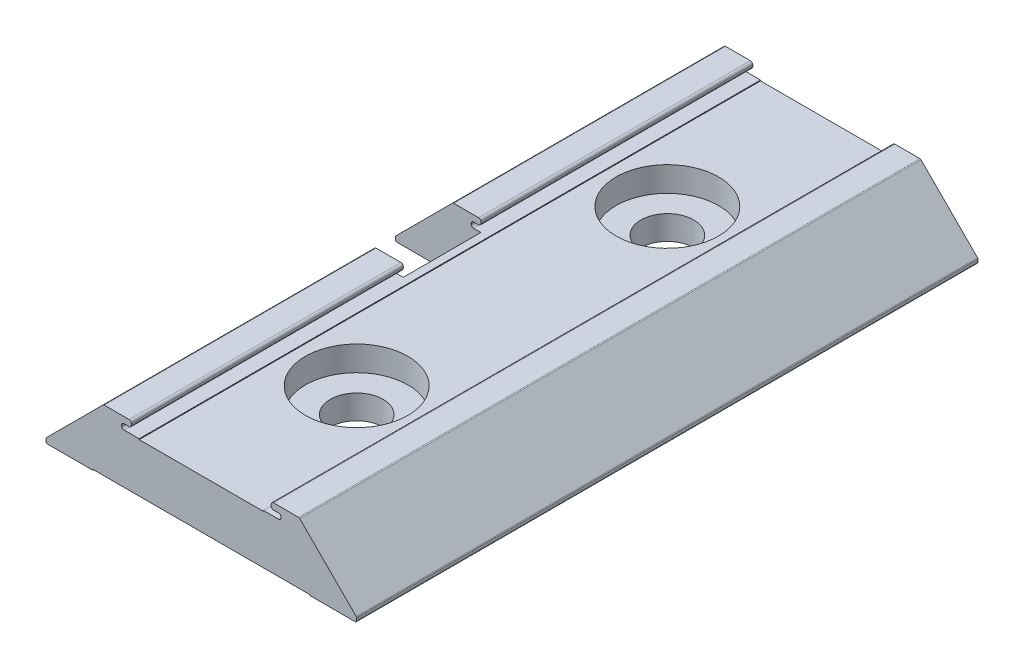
from build123d import *

# Parameters (mm, degrees)
EXTRUDE1_DEPTH                                      = 40
CBORE_FOR_M3_HEX_SOCKET_HEAD_CAP_SCREW1_D           = 3.4
CBORE_FOR_M3_HEX_SOCKET_HEAD_CAP_SCREW1_CBORE_D     = 6.6
CBORE_FOR_M3_HEX_SOCKET_HEAD_CAP_SCREW1_CBORE_DEPTH = 1.6
LPATTERN1_COUNT                                     = 2
LPATTERN1_PITCH                                     = 20
SKETCH6_W                                           = 5
SKETCH6_H                                           = 12.06825605
EXTRUDE2_DEPTH                                      = 5.5
M1_6_TAPPED_HOLE1_D                                 = 1.25
M1_6_TAPPED_HOLE1_DEPTH                             = 6.05
M1_6_TAPPED_HOLE1_TIP                               = 0.375537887


with BuildPart() as part:
    # Sketch1 → Extrude1 (new body)
    with BuildSketch(Plane.XY):
        with BuildLine():
            Line((0.1, 0), (3, 0))
            Line((3, 0), (3, 0.05))
            Line((3, 0.05), (17, 0.05))
            Line((17, 0.05), (17, 0))
            Line((17, 0), (19.9, 0))
            ThreePointArc((19.9, 0), (19.970710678, 0.029289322), (20, 0.1))
            Line((20, 0.1), (20, 0.258578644))
            ThreePointArc((20, 0.258578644), (19.992387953, 0.296846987), (19.970710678, 0.329289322))
            Line((19.970710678, 0.329289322), (16.329289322, 3.970710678))
            ThreePointArc((16.329289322, 3.970710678), (16.296846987, 3.992387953), (16.258578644, 4))
            Line((16.258578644, 4), (14.65, 4))
            ThreePointArc((14.65, 4), (14.543933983, 3.956066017), (14.5, 3.85))
            Line((14.5, 3.85), (14.5, 3.75))
            ThreePointArc((14.5, 3.75), (14.543933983, 3.643933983), (14.65, 3.6))
            Line((14.65, 3.6), (14.975, 3.6))
            ThreePointArc((14.975, 3.6), (15.081066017, 3.556066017), (15.125, 3.45))
            Line((15.125, 3.45), (15.125, 3.4))
            ThreePointArc((15.125, 3.4), (15.081066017, 3.293933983), (14.975, 3.25))
            Line((14.975, 3.25), (14, 3.25))
            Line((14, 3.25), (14, 3.2))
            Line((14, 3.2), (9.9, 3.2))
            Line((9.9, 3.2), (6, 3.2))
            Line((6, 3.2), (6, 3.25))
            Line((6, 3.25), (5.025, 3.25))
            ThreePointArc((5.025, 3.25), (4.918933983, 3.293933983), (4.875, 3.4))
            Line((4.875, 3.4), (4.875, 3.45))
            ThreePointArc((4.875, 3.45), (4.918933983, 3.556066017), (5.025, 3.6))
            Line((5.025, 3.6), (5.35, 3.6))
            ThreePointArc((5.35, 3.6), (5.456066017, 3.643933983), (5.5, 3.75))
            Line((5.5, 3.75), (5.5, 3.85))
            ThreePointArc((5.5, 3.85), (5.456066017, 3.956066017), (5.35, 4))
            Line((5.35, 4), (3.741421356, 4))
            ThreePointArc((3.741421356, 4), (3.703153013, 3.992387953), (3.670710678, 3.970710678))
            Line((3.670710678, 3.970710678), (0.029289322, 0.329289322))
            ThreePointArc((0.029289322, 0.329289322), (0.007612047, 0.296846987), (0, 0.258578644))
            Line((0, 0.258578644), (0, 0.1))
            ThreePointArc((0, 0.1), (0.029289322, 0.029289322), (0.1, 0))
        make_face()
    extrude(amount=EXTRUDE1_DEPTH)

    # CBORE for M3 Hex Socket Head Cap Screw1 (through all)
    with Locations(Plane(origin=(0, 3.2, 0), x_dir=(-1, 0, 0), z_dir=(0, 1, 0))):
        with Locations((-10, 10)):
            cbore_for_m3_hex_socket_head_cap_screw1 = CounterBoreHole(CBORE_FOR_M3_HEX_SOCKET_HEAD_CAP_SCREW1_D / 2, CBORE_FOR_M3_HEX_SOCKET_HEAD_CAP_SCREW1_CBORE_D / 2, CBORE_FOR_M3_HEX_SOCKET_HEAD_CAP_SCREW1_CBORE_DEPTH)

    # LPattern1: CBORE for M3 Hex Socket Head Cap Screw1 ×2
    with Locations(*[(0, 0, i * LPATTERN1_PITCH) for i in range(1, LPATTERN1_COUNT)]):
        add(cbore_for_m3_hex_socket_head_cap_screw1, mode=Mode.SUBTRACT)

    # Sketch6 → Extrude2 (cut)
    with BuildSketch(Plane.ZY):
        with Locations((20, 1.798862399)):
            Rectangle(SKETCH6_W, SKETCH6_H)
    extrude(amount=-EXTRUDE2_DEPTH, mode=Mode.SUBTRACT)

    # M1.6 Tapped Hole1
    with Locations(Plane.ZY.offset(-5.5)):
        with Locations((20, 1.8)):
            Hole(M1_6_TAPPED_HOLE1_D / 2, depth=M1_6_TAPPED_HOLE1_DEPTH)
            with Locations((0, 0, -(M1_6_TAPPED_HOLE1_DEPTH + M1_6_TAPPED_HOLE1_TIP / 2))):  # 118° drill point
                Cone(0, M1_6_TAPPED_HOLE1_D / 2, M1_6_TAPPED_HOLE1_TIP, mode=Mode.SUBTRACT)


solid = part.part
